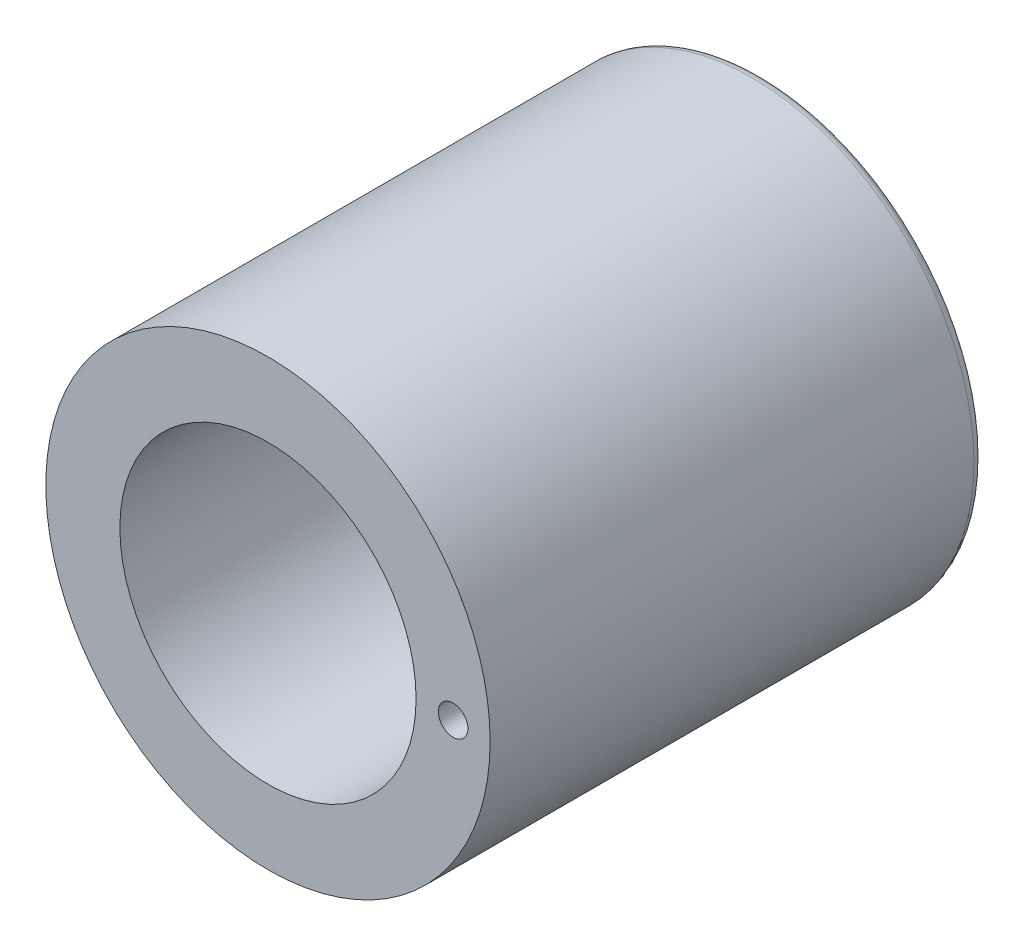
ISO-10303-21;
HEADER;
FILE_DESCRIPTION(('STEP AP214'),'2;1');
FILE_NAME('part.step','',(''),(''),'','','');
FILE_SCHEMA(('AUTOMOTIVE_DESIGN { 1 0 10303 214 1 1 1 1 }'));
ENDSEC;
DATA;
#1=APPLICATION_CONTEXT('core data for automotive mechanical design processes');
#2=APPLICATION_PROTOCOL_DEFINITION('international standard','automotive_design',2000,#1);
#3=PRODUCT_CONTEXT('',#1,'mechanical');
#4=PRODUCT('Part','Part','',(#3));
#5=PRODUCT_RELATED_PRODUCT_CATEGORY('part','',(#4));
#6=PRODUCT_DEFINITION_FORMATION('','',#4);
#7=PRODUCT_DEFINITION_CONTEXT('part definition',#1,'design');
#8=PRODUCT_DEFINITION('design','',#6,#7);
#9=PRODUCT_DEFINITION_SHAPE('','',#8);
#10=(LENGTH_UNIT() NAMED_UNIT(*) SI_UNIT(.MILLI.,.METRE.));
#11=(NAMED_UNIT(*) PLANE_ANGLE_UNIT() SI_UNIT($,.RADIAN.));
#12=(NAMED_UNIT(*) SI_UNIT($,.STERADIAN.) SOLID_ANGLE_UNIT());
#13=UNCERTAINTY_MEASURE_WITH_UNIT(LENGTH_MEASURE(1.E-05),#10,'distance_accuracy_value','');
#14=(GEOMETRIC_REPRESENTATION_CONTEXT(3) GLOBAL_UNCERTAINTY_ASSIGNED_CONTEXT((#13)) GLOBAL_UNIT_ASSIGNED_CONTEXT((#10,
#11,#12)) REPRESENTATION_CONTEXT('',''));
#15=CARTESIAN_POINT('',(0.,0.,0.));
#16=DIRECTION('',(0.,0.,1.));
#17=DIRECTION('',(1.,0.,0.));
#18=AXIS2_PLACEMENT_3D('',#15,#16,#17);
#19=CARTESIAN_POINT('',(0.,0.,100.));
#20=DIRECTION('',(0.,0.,-1.));
#21=DIRECTION('',(-1.,0.,0.));
#22=AXIS2_PLACEMENT_3D('',#19,#20,#21);
#23=CYLINDRICAL_SURFACE('',#22,45.);
#24=CARTESIAN_POINT('',(0.,0.,2.));
#25=DIRECTION('',(0.,0.,1.));
#26=DIRECTION('',(1.,0.,0.));
#27=AXIS2_PLACEMENT_3D('',#24,#25,#26);
#28=CIRCLE('',#27,45.);
#29=CARTESIAN_POINT('',(45.,0.,2.));
#30=VERTEX_POINT('',#29);
#31=EDGE_CURVE('E36',#30,#30,#28,.T.);
#32=ORIENTED_EDGE('',*,*,#31,.T.);
#33=EDGE_LOOP('',(#32));
#34=FACE_BOUND('',#33,.T.);
#35=CARTESIAN_POINT('',(0.,0.,100.));
#36=DIRECTION('',(0.,0.,1.));
#37=DIRECTION('',(1.,0.,0.));
#38=AXIS2_PLACEMENT_3D('',#35,#36,#37);
#39=CIRCLE('',#38,45.);
#40=CARTESIAN_POINT('',(45.,0.,100.));
#41=VERTEX_POINT('',#40);
#42=EDGE_CURVE('E40',#41,#41,#39,.T.);
#43=ORIENTED_EDGE('',*,*,#42,.F.);
#44=EDGE_LOOP('',(#43));
#45=FACE_BOUND('',#44,.T.);
#46=ADVANCED_FACE('F30',(#34,#45),#23,.T.);
#47=CARTESIAN_POINT('',(0.,0.,100.));
#48=DIRECTION('',(0.,0.,1.));
#49=DIRECTION('',(1.,0.,0.));
#50=AXIS2_PLACEMENT_3D('',#47,#48,#49);
#51=PLANE('',#50);
#52=CARTESIAN_POINT('',(37.5,0.,100.));
#53=DIRECTION('',(0.,0.,1.));
#54=DIRECTION('',(1.,0.,0.));
#55=AXIS2_PLACEMENT_3D('',#52,#53,#54);
#56=CIRCLE('',#55,3.);
#57=CARTESIAN_POINT('',(40.5,0.,100.));
#58=VERTEX_POINT('',#57);
#59=EDGE_CURVE('E55',#58,#58,#56,.T.);
#60=ORIENTED_EDGE('',*,*,#59,.F.);
#61=EDGE_LOOP('',(#60));
#62=FACE_BOUND('',#61,.T.);
#63=CARTESIAN_POINT('',(0.,0.,100.));
#64=DIRECTION('',(0.,0.,1.));
#65=DIRECTION('',(1.,0.,0.));
#66=AXIS2_PLACEMENT_3D('',#63,#64,#65);
#67=CIRCLE('',#66,30.);
#68=CARTESIAN_POINT('',(30.,0.,100.));
#69=VERTEX_POINT('',#68);
#70=EDGE_CURVE('E49',#69,#69,#67,.T.);
#71=ORIENTED_EDGE('',*,*,#70,.F.);
#72=EDGE_LOOP('',(#71));
#73=FACE_BOUND('',#72,.T.);
#74=ORIENTED_EDGE('',*,*,#42,.T.);
#75=EDGE_LOOP('',(#74));
#76=FACE_BOUND('',#75,.T.);
#77=ADVANCED_FACE('F61',(#62,#73,#76),#51,.T.);
#78=CARTESIAN_POINT('',(0.,0.,0.));
#79=DIRECTION('',(0.,0.,1.));
#80=DIRECTION('',(1.,0.,0.));
#81=AXIS2_PLACEMENT_3D('',#78,#79,#80);
#82=PLANE('',#81);
#83=CARTESIAN_POINT('',(0.,0.,0.));
#84=DIRECTION('',(0.,0.,1.));
#85=DIRECTION('',(1.,0.,0.));
#86=AXIS2_PLACEMENT_3D('',#83,#84,#85);
#87=CIRCLE('',#86,43.);
#88=CARTESIAN_POINT('',(43.,0.,0.));
#89=VERTEX_POINT('',#88);
#90=EDGE_CURVE('E10',#89,#89,#87,.F.);
#91=ORIENTED_EDGE('',*,*,#90,.T.);
#92=EDGE_LOOP('',(#91));
#93=FACE_BOUND('',#92,.T.);
#94=CARTESIAN_POINT('',(0.,0.,0.));
#95=DIRECTION('',(0.,0.,1.));
#96=DIRECTION('',(1.,0.,0.));
#97=AXIS2_PLACEMENT_3D('',#94,#95,#96);
#98=CIRCLE('',#97,30.);
#99=CARTESIAN_POINT('',(30.,0.,0.));
#100=VERTEX_POINT('',#99);
#101=EDGE_CURVE('E44',#100,#100,#98,.T.);
#102=ORIENTED_EDGE('',*,*,#101,.T.);
#103=EDGE_LOOP('',(#102));
#104=FACE_BOUND('',#103,.T.);
#105=ADVANCED_FACE('F64',(#93,#104),#82,.F.);
#106=CARTESIAN_POINT('',(0.,0.,0.));
#107=DIRECTION('',(0.,0.,1.));
#108=DIRECTION('',(1.,0.,0.));
#109=AXIS2_PLACEMENT_3D('',#106,#107,#108);
#110=CYLINDRICAL_SURFACE('',#109,30.);
#111=ORIENTED_EDGE('',*,*,#101,.F.);
#112=EDGE_LOOP('',(#111));
#113=FACE_BOUND('',#112,.T.);
#114=ORIENTED_EDGE('',*,*,#70,.T.);
#115=EDGE_LOOP('',(#114));
#116=FACE_BOUND('',#115,.T.);
#117=ADVANCED_FACE('F82',(#113,#116),#110,.F.);
#118=CARTESIAN_POINT('',(37.5,0.,70.));
#119=DIRECTION('',(0.,0.,1.));
#120=DIRECTION('',(1.,0.,0.));
#121=AXIS2_PLACEMENT_3D('',#118,#119,#120);
#122=CYLINDRICAL_SURFACE('',#121,3.);
#123=CARTESIAN_POINT('',(37.5,0.,70.));
#124=DIRECTION('',(0.,0.,1.));
#125=DIRECTION('',(1.,0.,0.));
#126=AXIS2_PLACEMENT_3D('',#123,#124,#125);
#127=CIRCLE('',#126,3.);
#128=CARTESIAN_POINT('',(40.5,0.,70.));
#129=VERTEX_POINT('',#128);
#130=EDGE_CURVE('E52',#129,#129,#127,.T.);
#131=ORIENTED_EDGE('',*,*,#130,.F.);
#132=EDGE_LOOP('',(#131));
#133=FACE_BOUND('',#132,.T.);
#134=ORIENTED_EDGE('',*,*,#59,.T.);
#135=EDGE_LOOP('',(#134));
#136=FACE_BOUND('',#135,.T.);
#137=ADVANCED_FACE('F59',(#133,#136),#122,.F.);
#138=CARTESIAN_POINT('',(37.5,0.,70.));
#139=DIRECTION('',(0.,0.,1.));
#140=DIRECTION('',(1.,0.,0.));
#141=AXIS2_PLACEMENT_3D('',#138,#139,#140);
#142=PLANE('',#141);
#143=ORIENTED_EDGE('',*,*,#130,.T.);
#144=EDGE_LOOP('',(#143));
#145=FACE_BOUND('',#144,.T.);
#146=ADVANCED_FACE('F96',(#145),#142,.T.);
#147=CARTESIAN_POINT('',(0.,0.,2.));
#148=DIRECTION('',(0.,0.,1.));
#149=DIRECTION('',(1.,0.,0.));
#150=AXIS2_PLACEMENT_3D('',#147,#148,#149);
#151=TOROIDAL_SURFACE('',#150,43.,2.);
#152=ORIENTED_EDGE('',*,*,#90,.F.);
#153=EDGE_LOOP('',(#152));
#154=FACE_BOUND('',#153,.T.);
#155=ORIENTED_EDGE('',*,*,#31,.F.);
#156=EDGE_LOOP('',(#155));
#157=FACE_BOUND('',#156,.T.);
#158=ADVANCED_FACE('F104',(#154,#157),#151,.T.);
#159=CLOSED_SHELL('',(#46,#77,#105,#117,#137,#146,#158));
#160=MANIFOLD_SOLID_BREP('B2',#159);
#161=ADVANCED_BREP_SHAPE_REPRESENTATION('',(#18,#160),#14);
#162=SHAPE_DEFINITION_REPRESENTATION(#9,#161);
ENDSEC;
END-ISO-10303-21;
